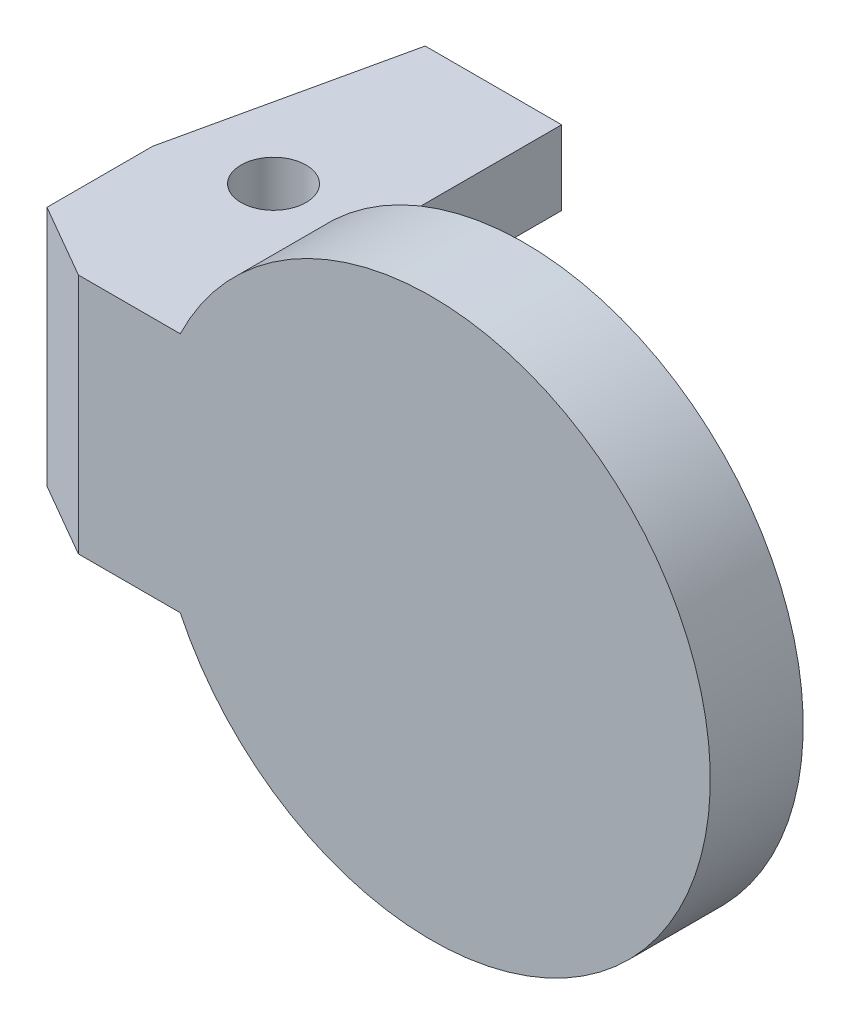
ISO-10303-21;
HEADER;
FILE_DESCRIPTION(('STEP AP214'),'2;1');
FILE_NAME('part.step','',(''),(''),'','','');
FILE_SCHEMA(('AUTOMOTIVE_DESIGN { 1 0 10303 214 1 1 1 1 }'));
ENDSEC;
DATA;
#1=APPLICATION_CONTEXT('core data for automotive mechanical design processes');
#2=APPLICATION_PROTOCOL_DEFINITION('international standard','automotive_design',2000,#1);
#3=PRODUCT_CONTEXT('',#1,'mechanical');
#4=PRODUCT('Part','Part','',(#3));
#5=PRODUCT_RELATED_PRODUCT_CATEGORY('part','',(#4));
#6=PRODUCT_DEFINITION_FORMATION('','',#4);
#7=PRODUCT_DEFINITION_CONTEXT('part definition',#1,'design');
#8=PRODUCT_DEFINITION('design','',#6,#7);
#9=PRODUCT_DEFINITION_SHAPE('','',#8);
#10=(LENGTH_UNIT() NAMED_UNIT(*) SI_UNIT(.MILLI.,.METRE.));
#11=(NAMED_UNIT(*) PLANE_ANGLE_UNIT() SI_UNIT($,.RADIAN.));
#12=(NAMED_UNIT(*) SI_UNIT($,.STERADIAN.) SOLID_ANGLE_UNIT());
#13=UNCERTAINTY_MEASURE_WITH_UNIT(LENGTH_MEASURE(1.E-05),#10,'distance_accuracy_value','');
#14=(GEOMETRIC_REPRESENTATION_CONTEXT(3) GLOBAL_UNCERTAINTY_ASSIGNED_CONTEXT((#13)) GLOBAL_UNIT_ASSIGNED_CONTEXT((#10,
#11,#12)) REPRESENTATION_CONTEXT('',''));
#15=CARTESIAN_POINT('',(0.,0.,0.));
#16=DIRECTION('',(0.,0.,1.));
#17=DIRECTION('',(1.,0.,0.));
#18=AXIS2_PLACEMENT_3D('',#15,#16,#17);
#19=CARTESIAN_POINT('',(0.,0.,5.));
#20=DIRECTION('',(0.,0.,-1.));
#21=DIRECTION('',(-1.,0.,0.));
#22=AXIS2_PLACEMENT_3D('',#19,#20,#21);
#23=CYLINDRICAL_SURFACE('',#22,15.);
#24=DIRECTION('',(0.,0.,-1.));
#25=VECTOR('',#24,1.);
#26=CARTESIAN_POINT('',(-13.5185058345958,-6.5,5.));
#27=LINE('',#26,#25);
#28=CARTESIAN_POINT('',(-13.5185058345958,-6.5,0.));
#29=VERTEX_POINT('',#28);
#30=CARTESIAN_POINT('',(-13.5185058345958,-6.5,5.));
#31=VERTEX_POINT('',#30);
#32=EDGE_CURVE('E160',#29,#31,#27,.F.);
#33=ORIENTED_EDGE('',*,*,#32,.F.);
#34=CARTESIAN_POINT('',(0.,0.,0.));
#35=DIRECTION('',(0.,0.,1.));
#36=DIRECTION('',(1.,0.,0.));
#37=AXIS2_PLACEMENT_3D('',#34,#35,#36);
#38=CIRCLE('',#37,15.);
#39=CARTESIAN_POINT('',(-13.5185058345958,6.5,0.));
#40=VERTEX_POINT('',#39);
#41=EDGE_CURVE('E188',#29,#40,#38,.T.);
#42=ORIENTED_EDGE('',*,*,#41,.T.);
#43=DIRECTION('',(0.,0.,-1.));
#44=VECTOR('',#43,1.);
#45=CARTESIAN_POINT('',(-13.5185058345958,6.5,5.));
#46=LINE('',#45,#44);
#47=CARTESIAN_POINT('',(-13.5185058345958,6.5,5.));
#48=VERTEX_POINT('',#47);
#49=EDGE_CURVE('E185',#48,#40,#46,.T.);
#50=ORIENTED_EDGE('',*,*,#49,.F.);
#51=CARTESIAN_POINT('',(0.,0.,5.));
#52=DIRECTION('',(0.,0.,1.));
#53=DIRECTION('',(1.,0.,0.));
#54=AXIS2_PLACEMENT_3D('',#51,#52,#53);
#55=CIRCLE('',#54,15.);
#56=EDGE_CURVE('E189',#31,#48,#55,.T.);
#57=ORIENTED_EDGE('',*,*,#56,.F.);
#58=EDGE_LOOP('',(#33,#42,#50,#57));
#59=FACE_BOUND('',#58,.T.);
#60=ADVANCED_FACE('F36',(#59),#23,.T.);
#61=CARTESIAN_POINT('',(0.,0.,0.));
#62=DIRECTION('',(0.,0.,1.));
#63=DIRECTION('',(1.,0.,0.));
#64=AXIS2_PLACEMENT_3D('',#61,#62,#63);
#65=PLANE('',#64);
#66=DIRECTION('',(0.,-1.,0.));
#67=VECTOR('',#66,1.);
#68=CARTESIAN_POINT('',(-13.,0.,0.));
#69=LINE('',#68,#67);
#70=CARTESIAN_POINT('',(-13.,-2.5,0.));
#71=VERTEX_POINT('',#70);
#72=CARTESIAN_POINT('',(-13.,-6.5,0.));
#73=VERTEX_POINT('',#72);
#74=EDGE_CURVE('E135',#71,#73,#69,.T.);
#75=ORIENTED_EDGE('',*,*,#74,.F.);
#76=DIRECTION('',(1.,0.,0.));
#77=VECTOR('',#76,1.);
#78=CARTESIAN_POINT('',(0.,-2.5,0.));
#79=LINE('',#78,#77);
#80=CARTESIAN_POINT('',(-23.,-2.5,0.));
#81=VERTEX_POINT('',#80);
#82=EDGE_CURVE('E129',#81,#71,#79,.T.);
#83=ORIENTED_EDGE('',*,*,#82,.F.);
#84=DIRECTION('',(0.,1.,0.));
#85=VECTOR('',#84,1.);
#86=CARTESIAN_POINT('',(-23.,-3.5,0.));
#87=LINE('',#86,#85);
#88=CARTESIAN_POINT('',(-23.,2.5,0.));
#89=VERTEX_POINT('',#88);
#90=EDGE_CURVE('E132',#81,#89,#87,.T.);
#91=ORIENTED_EDGE('',*,*,#90,.T.);
#92=DIRECTION('',(-1.,0.,0.));
#93=VECTOR('',#92,1.);
#94=CARTESIAN_POINT('',(0.,2.5,0.));
#95=LINE('',#94,#93);
#96=CARTESIAN_POINT('',(-13.,2.5,0.));
#97=VERTEX_POINT('',#96);
#98=EDGE_CURVE('E192',#97,#89,#95,.T.);
#99=ORIENTED_EDGE('',*,*,#98,.F.);
#100=DIRECTION('',(0.,-1.,0.));
#101=VECTOR('',#100,1.);
#102=CARTESIAN_POINT('',(-13.,0.,0.));
#103=LINE('',#102,#101);
#104=CARTESIAN_POINT('',(-13.,6.5,0.));
#105=VERTEX_POINT('',#104);
#106=EDGE_CURVE('E195',#105,#97,#103,.T.);
#107=ORIENTED_EDGE('',*,*,#106,.F.);
#108=DIRECTION('',(1.,0.,0.));
#109=VECTOR('',#108,1.);
#110=CARTESIAN_POINT('',(0.,6.5,0.));
#111=LINE('',#110,#109);
#112=EDGE_CURVE('E198',#40,#105,#111,.T.);
#113=ORIENTED_EDGE('',*,*,#112,.F.);
#114=ORIENTED_EDGE('',*,*,#41,.F.);
#115=DIRECTION('',(-1.,0.,0.));
#116=VECTOR('',#115,1.);
#117=CARTESIAN_POINT('',(0.,-6.5,0.));
#118=LINE('',#117,#116);
#119=EDGE_CURVE('E156',#73,#29,#118,.T.);
#120=ORIENTED_EDGE('',*,*,#119,.F.);
#121=EDGE_LOOP('',(#75,#83,#91,#99,#107,#113,#114,#120));
#122=FACE_BOUND('',#121,.T.);
#123=ADVANCED_FACE('F131',(#122),#65,.F.);
#124=CARTESIAN_POINT('',(0.,0.,5.));
#125=DIRECTION('',(0.,0.,1.));
#126=DIRECTION('',(1.,0.,0.));
#127=AXIS2_PLACEMENT_3D('',#124,#125,#126);
#128=PLANE('',#127);
#129=ORIENTED_EDGE('',*,*,#56,.T.);
#130=DIRECTION('',(1.,0.,0.));
#131=VECTOR('',#130,1.);
#132=CARTESIAN_POINT('',(-23.,6.5,5.));
#133=LINE('',#132,#131);
#134=CARTESIAN_POINT('',(-19.,6.5,5.));
#135=VERTEX_POINT('',#134);
#136=EDGE_CURVE('E140',#135,#48,#133,.T.);
#137=ORIENTED_EDGE('',*,*,#136,.F.);
#138=DIRECTION('',(0.,-1.,0.));
#139=VECTOR('',#138,1.);
#140=CARTESIAN_POINT('',(-19.,2.5,5.));
#141=LINE('',#140,#139);
#142=CARTESIAN_POINT('',(-19.,-6.5,5.));
#143=VERTEX_POINT('',#142);
#144=EDGE_CURVE('E209',#135,#143,#141,.T.);
#145=ORIENTED_EDGE('',*,*,#144,.T.);
#146=DIRECTION('',(-1.,0.,0.));
#147=VECTOR('',#146,1.);
#148=CARTESIAN_POINT('',(-23.,-6.5,5.));
#149=LINE('',#148,#147);
#150=EDGE_CURVE('E219',#31,#143,#149,.T.);
#151=ORIENTED_EDGE('',*,*,#150,.F.);
#152=EDGE_LOOP('',(#129,#137,#145,#151));
#153=FACE_BOUND('',#152,.T.);
#154=ADVANCED_FACE('F227',(#153),#128,.T.);
#155=CARTESIAN_POINT('',(-23.,6.5,-15.));
#156=DIRECTION('',(0.,-1.,0.));
#157=DIRECTION('',(1.,0.,0.));
#158=AXIS2_PLACEMENT_3D('',#155,#156,#157);
#159=PLANE('',#158);
#160=CARTESIAN_POINT('',(-18.,6.5,-4.5));
#161=DIRECTION('',(0.,1.,0.));
#162=DIRECTION('',(-1.,0.,0.));
#163=AXIS2_PLACEMENT_3D('',#160,#161,#162);
#164=CIRCLE('',#163,1.75);
#165=CARTESIAN_POINT('',(-19.75,6.5,-4.5));
#166=VERTEX_POINT('',#165);
#167=EDGE_CURVE('E150',#166,#166,#164,.T.);
#168=ORIENTED_EDGE('',*,*,#167,.F.);
#169=EDGE_LOOP('',(#168));
#170=FACE_BOUND('',#169,.T.);
#171=DIRECTION('',(0.,0.,1.));
#172=VECTOR('',#171,1.);
#173=CARTESIAN_POINT('',(-23.,6.5,-15.));
#174=LINE('',#173,#172);
#175=CARTESIAN_POINT('',(-23.,6.5,-3.));
#176=VERTEX_POINT('',#175);
#177=CARTESIAN_POINT('',(-23.,6.5,2.69059892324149));
#178=VERTEX_POINT('',#177);
#179=EDGE_CURVE('E50',#176,#178,#174,.T.);
#180=ORIENTED_EDGE('',*,*,#179,.T.);
#181=DIRECTION('',(0.86602540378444,0.,0.499999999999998));
#182=VECTOR('',#181,1.);
#183=CARTESIAN_POINT('',(-23.,6.5,2.6905989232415));
#184=LINE('',#183,#182);
#185=EDGE_CURVE('E11',#178,#135,#184,.T.);
#186=ORIENTED_EDGE('',*,*,#185,.T.);
#187=ORIENTED_EDGE('',*,*,#136,.T.);
#188=ORIENTED_EDGE('',*,*,#49,.T.);
#189=ORIENTED_EDGE('',*,*,#112,.T.);
#190=DIRECTION('',(0.,0.,1.));
#191=VECTOR('',#190,1.);
#192=CARTESIAN_POINT('',(-13.,6.5,-15.));
#193=LINE('',#192,#191);
#194=CARTESIAN_POINT('',(-13.,6.5,-15.));
#195=VERTEX_POINT('',#194);
#196=EDGE_CURVE('E182',#195,#105,#193,.T.);
#197=ORIENTED_EDGE('',*,*,#196,.F.);
#198=DIRECTION('',(1.,0.,0.));
#199=VECTOR('',#198,1.);
#200=CARTESIAN_POINT('',(-23.,6.5,-15.));
#201=LINE('',#200,#199);
#202=CARTESIAN_POINT('',(-20.3396640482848,6.5,-15.));
#203=VERTEX_POINT('',#202);
#204=EDGE_CURVE('E170',#203,#195,#201,.T.);
#205=ORIENTED_EDGE('',*,*,#204,.F.);
#206=DIRECTION('',(0.216439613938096,0.,-0.976296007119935));
#207=VECTOR('',#206,1.);
#208=CARTESIAN_POINT('',(-20.3396640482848,6.5,-15.));
#209=LINE('',#208,#207);
#210=EDGE_CURVE('E248',#176,#203,#209,.T.);
#211=ORIENTED_EDGE('',*,*,#210,.F.);
#212=EDGE_LOOP('',(#180,#186,#187,#188,#189,#197,#205,#211));
#213=FACE_BOUND('',#212,.T.);
#214=ADVANCED_FACE('F229',(#170,#213),#159,.F.);
#215=CARTESIAN_POINT('',(-13.,6.5,-15.));
#216=DIRECTION('',(-1.,0.,0.));
#217=DIRECTION('',(0.,-1.,0.));
#218=AXIS2_PLACEMENT_3D('',#215,#216,#217);
#219=PLANE('',#218);
#220=ORIENTED_EDGE('',*,*,#196,.T.);
#221=ORIENTED_EDGE('',*,*,#106,.T.);
#222=DIRECTION('',(0.,0.,1.));
#223=VECTOR('',#222,1.);
#224=CARTESIAN_POINT('',(-13.,2.5,-15.));
#225=LINE('',#224,#223);
#226=CARTESIAN_POINT('',(-13.,2.5,-15.));
#227=VERTEX_POINT('',#226);
#228=EDGE_CURVE('E179',#227,#97,#225,.T.);
#229=ORIENTED_EDGE('',*,*,#228,.F.);
#230=DIRECTION('',(0.,-1.,0.));
#231=VECTOR('',#230,1.);
#232=CARTESIAN_POINT('',(-13.,6.5,-15.));
#233=LINE('',#232,#231);
#234=EDGE_CURVE('E172',#195,#227,#233,.T.);
#235=ORIENTED_EDGE('',*,*,#234,.F.);
#236=EDGE_LOOP('',(#220,#221,#229,#235));
#237=FACE_BOUND('',#236,.T.);
#238=ADVANCED_FACE('F236',(#237),#219,.F.);
#239=CARTESIAN_POINT('',(-13.,2.5,-15.));
#240=DIRECTION('',(0.,1.,0.));
#241=DIRECTION('',(-1.,0.,0.));
#242=AXIS2_PLACEMENT_3D('',#239,#240,#241);
#243=PLANE('',#242);
#244=CARTESIAN_POINT('',(-18.,2.5,-4.5));
#245=DIRECTION('',(0.,1.,0.));
#246=DIRECTION('',(-1.,0.,0.));
#247=AXIS2_PLACEMENT_3D('',#244,#245,#246);
#248=CIRCLE('',#247,1.75);
#249=CARTESIAN_POINT('',(-19.75,2.5,-4.5));
#250=VERTEX_POINT('',#249);
#251=EDGE_CURVE('E251',#250,#250,#248,.T.);
#252=ORIENTED_EDGE('',*,*,#251,.T.);
#253=EDGE_LOOP('',(#252));
#254=FACE_BOUND('',#253,.T.);
#255=ORIENTED_EDGE('',*,*,#98,.T.);
#256=DIRECTION('',(0.,0.,1.));
#257=VECTOR('',#256,1.);
#258=CARTESIAN_POINT('',(-23.,2.5,-15.));
#259=LINE('',#258,#257);
#260=CARTESIAN_POINT('',(-23.,2.5,-3.));
#261=VERTEX_POINT('',#260);
#262=EDGE_CURVE('E149',#261,#89,#259,.T.);
#263=ORIENTED_EDGE('',*,*,#262,.F.);
#264=DIRECTION('',(0.216439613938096,0.,-0.976296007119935));
#265=VECTOR('',#264,1.);
#266=CARTESIAN_POINT('',(-19.9958293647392,2.5,-16.5509380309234));
#267=LINE('',#266,#265);
#268=CARTESIAN_POINT('',(-20.3396640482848,2.5,-15.));
#269=VERTEX_POINT('',#268);
#270=EDGE_CURVE('E242',#261,#269,#267,.T.);
#271=ORIENTED_EDGE('',*,*,#270,.T.);
#272=DIRECTION('',(-1.,0.,0.));
#273=VECTOR('',#272,1.);
#274=CARTESIAN_POINT('',(-13.,2.5,-15.));
#275=LINE('',#274,#273);
#276=EDGE_CURVE('E174',#227,#269,#275,.T.);
#277=ORIENTED_EDGE('',*,*,#276,.F.);
#278=ORIENTED_EDGE('',*,*,#228,.T.);
#279=EDGE_LOOP('',(#255,#263,#271,#277,#278));
#280=FACE_BOUND('',#279,.T.);
#281=ADVANCED_FACE('F240',(#254,#280),#243,.F.);
#282=CARTESIAN_POINT('',(-23.,2.5,-15.));
#283=DIRECTION('',(1.,0.,0.));
#284=DIRECTION('',(0.,0.,-1.));
#285=AXIS2_PLACEMENT_3D('',#282,#283,#284);
#286=PLANE('',#285);
#287=ORIENTED_EDGE('',*,*,#262,.T.);
#288=ORIENTED_EDGE('',*,*,#90,.F.);
#289=DIRECTION('',(0.,0.,1.));
#290=VECTOR('',#289,1.);
#291=CARTESIAN_POINT('',(-23.,-2.5,-15.));
#292=LINE('',#291,#290);
#293=CARTESIAN_POINT('',(-23.,-2.5,-3.));
#294=VERTEX_POINT('',#293);
#295=EDGE_CURVE('E146',#294,#81,#292,.T.);
#296=ORIENTED_EDGE('',*,*,#295,.F.);
#297=DIRECTION('',(0.,1.,0.));
#298=VECTOR('',#297,1.);
#299=CARTESIAN_POINT('',(-23.,-15.,-3.));
#300=LINE('',#299,#298);
#301=CARTESIAN_POINT('',(-23.,-6.5,-3.));
#302=VERTEX_POINT('',#301);
#303=EDGE_CURVE('E223',#302,#294,#300,.T.);
#304=ORIENTED_EDGE('',*,*,#303,.F.);
#305=DIRECTION('',(0.,0.,1.));
#306=VECTOR('',#305,1.);
#307=CARTESIAN_POINT('',(-23.,-6.5,-15.));
#308=LINE('',#307,#306);
#309=CARTESIAN_POINT('',(-23.,-6.5,2.69059892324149));
#310=VERTEX_POINT('',#309);
#311=EDGE_CURVE('E217',#302,#310,#308,.T.);
#312=ORIENTED_EDGE('',*,*,#311,.T.);
#313=DIRECTION('',(0.,1.,0.));
#314=VECTOR('',#313,1.);
#315=CARTESIAN_POINT('',(-23.,-2.5,2.6905989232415));
#316=LINE('',#315,#314);
#317=EDGE_CURVE('E203',#310,#178,#316,.T.);
#318=ORIENTED_EDGE('',*,*,#317,.T.);
#319=ORIENTED_EDGE('',*,*,#179,.F.);
#320=EDGE_CURVE('E250',#261,#176,#300,.T.);
#321=ORIENTED_EDGE('',*,*,#320,.F.);
#322=EDGE_LOOP('',(#287,#288,#296,#304,#312,#318,#319,#321));
#323=FACE_BOUND('',#322,.T.);
#324=ADVANCED_FACE('F144',(#323),#286,.F.);
#325=CARTESIAN_POINT('',(-23.,6.5,-15.));
#326=DIRECTION('',(0.,0.,1.));
#327=DIRECTION('',(1.,0.,0.));
#328=AXIS2_PLACEMENT_3D('',#325,#326,#327);
#329=PLANE('',#328);
#330=ORIENTED_EDGE('',*,*,#276,.T.);
#331=DIRECTION('',(0.,1.,0.));
#332=VECTOR('',#331,1.);
#333=CARTESIAN_POINT('',(-20.3396640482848,-15.,-15.));
#334=LINE('',#333,#332);
#335=EDGE_CURVE('E246',#269,#203,#334,.T.);
#336=ORIENTED_EDGE('',*,*,#335,.T.);
#337=ORIENTED_EDGE('',*,*,#204,.T.);
#338=ORIENTED_EDGE('',*,*,#234,.T.);
#339=EDGE_LOOP('',(#330,#336,#337,#338));
#340=FACE_BOUND('',#339,.T.);
#341=ADVANCED_FACE('F245',(#340),#329,.F.);
#342=CARTESIAN_POINT('',(-13.,-2.5,-15.));
#343=DIRECTION('',(0.,-1.,0.));
#344=DIRECTION('',(1.,0.,0.));
#345=AXIS2_PLACEMENT_3D('',#342,#343,#344);
#346=PLANE('',#345);
#347=CARTESIAN_POINT('',(-18.,-2.5,-4.5));
#348=DIRECTION('',(0.,-1.,0.));
#349=DIRECTION('',(1.,0.,0.));
#350=AXIS2_PLACEMENT_3D('',#347,#348,#349);
#351=CIRCLE('',#350,1.75);
#352=CARTESIAN_POINT('',(-16.25,-2.5,-4.5));
#353=VERTEX_POINT('',#352);
#354=EDGE_CURVE('E207',#353,#353,#351,.T.);
#355=ORIENTED_EDGE('',*,*,#354,.T.);
#356=EDGE_LOOP('',(#355));
#357=FACE_BOUND('',#356,.T.);
#358=ORIENTED_EDGE('',*,*,#295,.T.);
#359=ORIENTED_EDGE('',*,*,#82,.T.);
#360=DIRECTION('',(0.,0.,1.));
#361=VECTOR('',#360,1.);
#362=CARTESIAN_POINT('',(-13.,-2.5,-15.));
#363=LINE('',#362,#361);
#364=CARTESIAN_POINT('',(-13.,-2.5,-15.));
#365=VERTEX_POINT('',#364);
#366=EDGE_CURVE('E157',#365,#71,#363,.T.);
#367=ORIENTED_EDGE('',*,*,#366,.F.);
#368=DIRECTION('',(1.,0.,0.));
#369=VECTOR('',#368,1.);
#370=CARTESIAN_POINT('',(-13.,-2.5,-15.));
#371=LINE('',#370,#369);
#372=CARTESIAN_POINT('',(-20.3396640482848,-2.5,-15.));
#373=VERTEX_POINT('',#372);
#374=EDGE_CURVE('E261',#373,#365,#371,.T.);
#375=ORIENTED_EDGE('',*,*,#374,.F.);
#376=DIRECTION('',(-0.216439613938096,0.,0.976296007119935));
#377=VECTOR('',#376,1.);
#378=CARTESIAN_POINT('',(-19.9958293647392,-2.5,-16.5509380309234));
#379=LINE('',#378,#377);
#380=EDGE_CURVE('E155',#373,#294,#379,.T.);
#381=ORIENTED_EDGE('',*,*,#380,.T.);
#382=EDGE_LOOP('',(#358,#359,#367,#375,#381));
#383=FACE_BOUND('',#382,.T.);
#384=ADVANCED_FACE('F153',(#357,#383),#346,.F.);
#385=CARTESIAN_POINT('',(-13.,-6.5,-15.));
#386=DIRECTION('',(-1.,0.,0.));
#387=DIRECTION('',(0.,-1.,0.));
#388=AXIS2_PLACEMENT_3D('',#385,#386,#387);
#389=PLANE('',#388);
#390=ORIENTED_EDGE('',*,*,#366,.T.);
#391=ORIENTED_EDGE('',*,*,#74,.T.);
#392=DIRECTION('',(0.,0.,1.));
#393=VECTOR('',#392,1.);
#394=CARTESIAN_POINT('',(-13.,-6.5,-15.));
#395=LINE('',#394,#393);
#396=CARTESIAN_POINT('',(-13.,-6.5,-15.));
#397=VERTEX_POINT('',#396);
#398=EDGE_CURVE('E162',#397,#73,#395,.T.);
#399=ORIENTED_EDGE('',*,*,#398,.F.);
#400=DIRECTION('',(0.,-1.,0.));
#401=VECTOR('',#400,1.);
#402=CARTESIAN_POINT('',(-13.,-6.5,-15.));
#403=LINE('',#402,#401);
#404=EDGE_CURVE('E263',#365,#397,#403,.T.);
#405=ORIENTED_EDGE('',*,*,#404,.F.);
#406=EDGE_LOOP('',(#390,#391,#399,#405));
#407=FACE_BOUND('',#406,.T.);
#408=ADVANCED_FACE('F271',(#407),#389,.F.);
#409=CARTESIAN_POINT('',(-23.,-6.5,-15.));
#410=DIRECTION('',(0.,1.,0.));
#411=DIRECTION('',(-1.,0.,0.));
#412=AXIS2_PLACEMENT_3D('',#409,#410,#411);
#413=PLANE('',#412);
#414=CARTESIAN_POINT('',(-18.,-6.5,-4.5));
#415=DIRECTION('',(0.,1.,0.));
#416=DIRECTION('',(-1.,0.,0.));
#417=AXIS2_PLACEMENT_3D('',#414,#415,#416);
#418=CIRCLE('',#417,1.75);
#419=CARTESIAN_POINT('',(-19.75,-6.5,-4.5));
#420=VERTEX_POINT('',#419);
#421=EDGE_CURVE('E204',#420,#420,#418,.T.);
#422=ORIENTED_EDGE('',*,*,#421,.T.);
#423=EDGE_LOOP('',(#422));
#424=FACE_BOUND('',#423,.T.);
#425=ORIENTED_EDGE('',*,*,#150,.T.);
#426=DIRECTION('',(-0.86602540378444,0.,-0.499999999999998));
#427=VECTOR('',#426,1.);
#428=CARTESIAN_POINT('',(-23.,-6.5,2.6905989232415));
#429=LINE('',#428,#427);
#430=EDGE_CURVE('E44',#143,#310,#429,.T.);
#431=ORIENTED_EDGE('',*,*,#430,.T.);
#432=ORIENTED_EDGE('',*,*,#311,.F.);
#433=DIRECTION('',(0.216439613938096,0.,-0.976296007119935));
#434=VECTOR('',#433,1.);
#435=CARTESIAN_POINT('',(-20.4642904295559,-6.5,-14.4378467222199));
#436=LINE('',#435,#434);
#437=CARTESIAN_POINT('',(-20.3396640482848,-6.5,-15.));
#438=VERTEX_POINT('',#437);
#439=EDGE_CURVE('E256',#302,#438,#436,.T.);
#440=ORIENTED_EDGE('',*,*,#439,.T.);
#441=DIRECTION('',(-1.,0.,0.));
#442=VECTOR('',#441,1.);
#443=CARTESIAN_POINT('',(-23.,-6.5,-15.));
#444=LINE('',#443,#442);
#445=EDGE_CURVE('E224',#397,#438,#444,.T.);
#446=ORIENTED_EDGE('',*,*,#445,.F.);
#447=ORIENTED_EDGE('',*,*,#398,.T.);
#448=ORIENTED_EDGE('',*,*,#119,.T.);
#449=ORIENTED_EDGE('',*,*,#32,.T.);
#450=EDGE_LOOP('',(#425,#431,#432,#440,#446,#447,#448,#449));
#451=FACE_BOUND('',#450,.T.);
#452=ADVANCED_FACE('F215',(#424,#451),#413,.F.);
#453=CARTESIAN_POINT('',(-23.,-2.5,-15.));
#454=DIRECTION('',(0.,0.,-1.));
#455=DIRECTION('',(-1.,0.,0.));
#456=AXIS2_PLACEMENT_3D('',#453,#454,#455);
#457=PLANE('',#456);
#458=DIRECTION('',(0.,-1.,0.));
#459=VECTOR('',#458,1.);
#460=CARTESIAN_POINT('',(-20.3396640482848,-2.5,-15.));
#461=LINE('',#460,#459);
#462=EDGE_CURVE('E201',#373,#438,#461,.T.);
#463=ORIENTED_EDGE('',*,*,#462,.F.);
#464=ORIENTED_EDGE('',*,*,#374,.T.);
#465=ORIENTED_EDGE('',*,*,#404,.T.);
#466=ORIENTED_EDGE('',*,*,#445,.T.);
#467=EDGE_LOOP('',(#463,#464,#465,#466));
#468=FACE_BOUND('',#467,.T.);
#469=ADVANCED_FACE('F274',(#468),#457,.T.);
#470=CARTESIAN_POINT('',(-20.3396640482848,-15.,-15.));
#471=DIRECTION('',(0.976296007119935,0.,0.216439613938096));
#472=DIRECTION('',(0.216439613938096,0.,-0.976296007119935));
#473=AXIS2_PLACEMENT_3D('',#470,#471,#472);
#474=PLANE('',#473);
#475=ORIENTED_EDGE('',*,*,#462,.T.);
#476=ORIENTED_EDGE('',*,*,#439,.F.);
#477=ORIENTED_EDGE('',*,*,#303,.T.);
#478=ORIENTED_EDGE('',*,*,#380,.F.);
#479=EDGE_LOOP('',(#475,#476,#477,#478));
#480=FACE_BOUND('',#479,.T.);
#481=ADVANCED_FACE('F276',(#480),#474,.F.);
#482=ORIENTED_EDGE('',*,*,#320,.T.);
#483=ORIENTED_EDGE('',*,*,#210,.T.);
#484=ORIENTED_EDGE('',*,*,#335,.F.);
#485=ORIENTED_EDGE('',*,*,#270,.F.);
#486=EDGE_LOOP('',(#482,#483,#484,#485));
#487=FACE_BOUND('',#486,.T.);
#488=ADVANCED_FACE('F278',(#487),#474,.F.);
#489=CARTESIAN_POINT('',(-18.,-15.,-4.5));
#490=DIRECTION('',(0.,1.,0.));
#491=DIRECTION('',(-1.,0.,0.));
#492=AXIS2_PLACEMENT_3D('',#489,#490,#491);
#493=CYLINDRICAL_SURFACE('',#492,1.75);
#494=ORIENTED_EDGE('',*,*,#421,.F.);
#495=EDGE_LOOP('',(#494));
#496=FACE_BOUND('',#495,.T.);
#497=ORIENTED_EDGE('',*,*,#354,.F.);
#498=EDGE_LOOP('',(#497));
#499=FACE_BOUND('',#498,.T.);
#500=ADVANCED_FACE('F284',(#496,#499),#493,.F.);
#501=ORIENTED_EDGE('',*,*,#167,.T.);
#502=EDGE_LOOP('',(#501));
#503=FACE_BOUND('',#502,.T.);
#504=ORIENTED_EDGE('',*,*,#251,.F.);
#505=EDGE_LOOP('',(#504));
#506=FACE_BOUND('',#505,.T.);
#507=ADVANCED_FACE('F320',(#503,#506),#493,.F.);
#508=CARTESIAN_POINT('',(-23.,-2.5,2.6905989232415));
#509=DIRECTION('',(-0.499999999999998,0.,0.86602540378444));
#510=DIRECTION('',(0.86602540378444,0.,0.499999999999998));
#511=AXIS2_PLACEMENT_3D('',#508,#509,#510);
#512=PLANE('',#511);
#513=ORIENTED_EDGE('',*,*,#185,.F.);
#514=ORIENTED_EDGE('',*,*,#317,.F.);
#515=ORIENTED_EDGE('',*,*,#430,.F.);
#516=ORIENTED_EDGE('',*,*,#144,.F.);
#517=EDGE_LOOP('',(#513,#514,#515,#516));
#518=FACE_BOUND('',#517,.T.);
#519=ADVANCED_FACE('F38',(#518),#512,.T.);
#520=CLOSED_SHELL('',(#60,#123,#154,#214,#238,#281,#324,#341,#384,#408,#452,#469,#481,#488,#500,
#507,#519));
#521=MANIFOLD_SOLID_BREP('B2',#520);
#522=ADVANCED_BREP_SHAPE_REPRESENTATION('',(#18,#521),#14);
#523=SHAPE_DEFINITION_REPRESENTATION(#9,#522);
ENDSEC;
END-ISO-10303-21;
